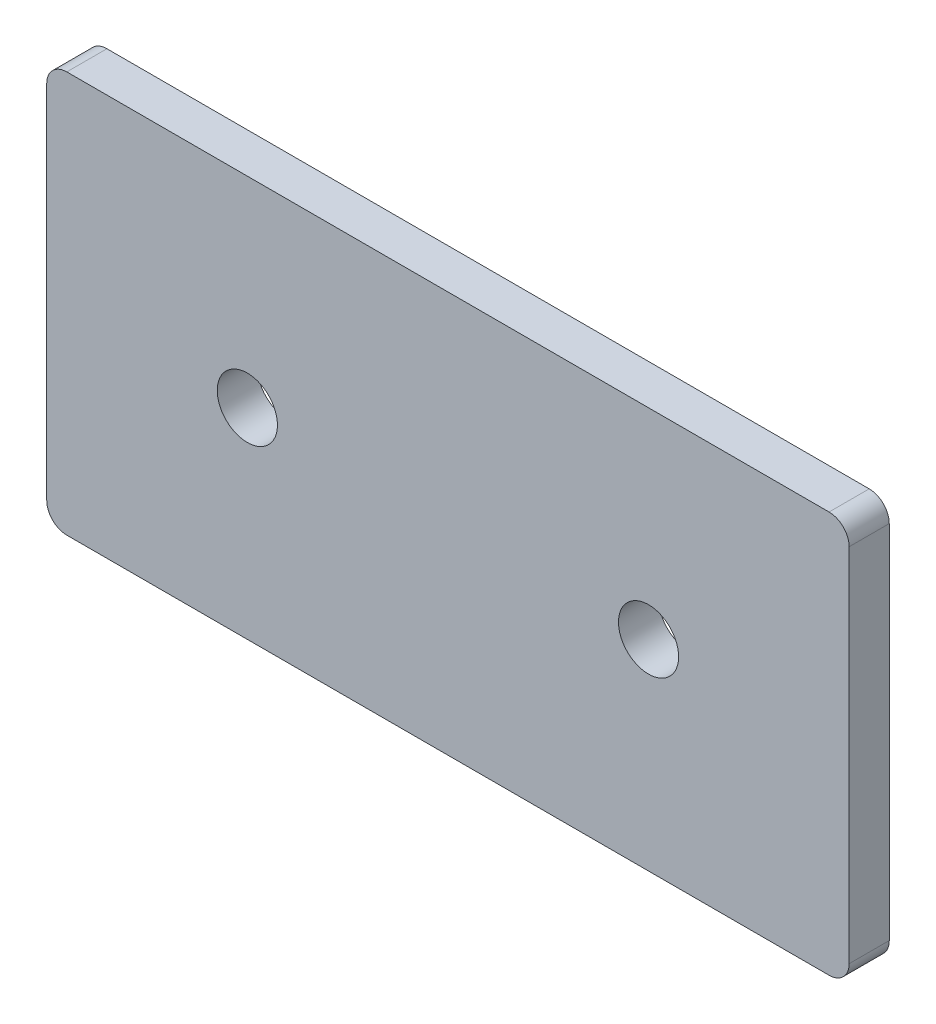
from build123d import *

# Parameters (mm, degrees)
BASE_EXTRUSION_DEPTH    = 4
ESQUISSE2_R             = 3
ENL_V_MAT_EXTRU_1_DEPTH = 90.532117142


with BuildPart() as part:
    # Esquisse1 → Base-Extrusion (new body)
    with BuildSketch(Plane.XY):
        with BuildLine():
            Line((2, 0), (78, 0))
            ThreePointArc((78, 0), (79.414213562, 0.585786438), (80, 2))
            Line((80, 2), (80, 38))
            ThreePointArc((80, 38), (79.414213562, 39.414213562), (78, 40))
            Line((78, 40), (2, 40))
            ThreePointArc((2, 40), (0.585786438, 39.414213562), (0, 38))
            Line((0, 38), (0, 2))
            ThreePointArc((0, 2), (0.585786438, 0.585786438), (2, 0))
        make_face()
    extrude(amount=BASE_EXTRUSION_DEPTH)

    # Esquisse2 → Enl_v. mat.-Extru.1 (cut, through all)
    with BuildSketch(Plane.XY.offset(4)):
        with Locations((60, 20)):
            Circle(ESQUISSE2_R)
        with Locations((20, 20)):
            Circle(ESQUISSE2_R)
    extrude(amount=-ENL_V_MAT_EXTRU_1_DEPTH, mode=Mode.SUBTRACT)


solid = part.part
